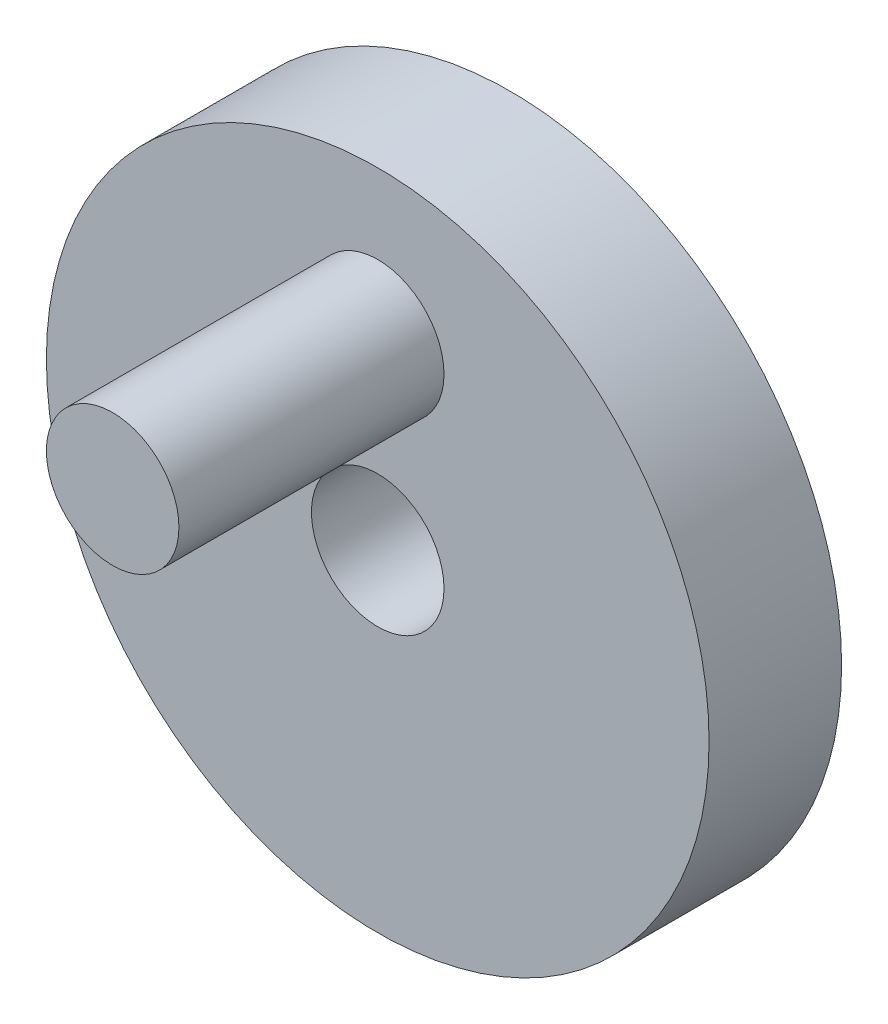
from build123d import *

# Parameters (mm, degrees)
SKETCH1_R           = 25
BOSS_EXTRUDE1_DEPTH = 10
SKETCH2_R           = 5
CUT_EXTRUDE1_DEPTH  = 10
SKETCH3_R           = 5
BOSS_EXTRUDE2_DEPTH = 20


with BuildPart() as part:
    # Sketch1 → Boss-Extrude1 (new body)
    with BuildSketch(Plane.XY):
        Circle(SKETCH1_R)
    extrude(amount=BOSS_EXTRUDE1_DEPTH)

    # Sketch2 → Cut-Extrude1 (cut)
    with BuildSketch(Plane.XY.offset(10)):
        Circle(SKETCH2_R)
    extrude(amount=-CUT_EXTRUDE1_DEPTH, mode=Mode.SUBTRACT)

    # Sketch3 → Boss-Extrude2 (add)
    with BuildSketch(Plane.XY.offset(10)):
        with Locations((0, 14)):
            Circle(SKETCH3_R)
    extrude(amount=BOSS_EXTRUDE2_DEPTH)


solid = part.part
